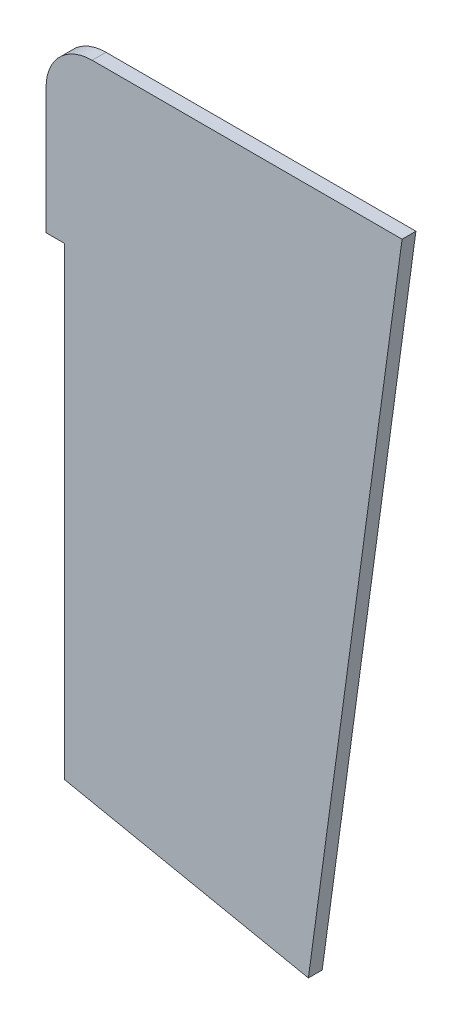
from build123d import *

# Parameters (mm, degrees)
RESSALTO_EXTRUS_O1_DEPTH = 3
FILETE1_R                = 10
CORTE_EXTRUS_O3_DEPTH    = 4


with BuildPart() as part:
    # Esbo_o2 → Ressalto-extrus_o1 (new body)
    with BuildSketch(Plane.XY):
        Polygon((236.744667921, 297.979893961), (179.797265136, 309.63253177), (179.797265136, 447.074042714), (257.090292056, 447.074042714), align=None)
    extrude(amount=-RESSALTO_EXTRUS_O1_DEPTH)

    # Filete1
    filete1_edges = [part.edges().sort_by_distance(p)[0] for p in [
        (179.797265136, 447.074042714, -1.5),
    ]]
    fillet(filete1_edges, radius=FILETE1_R)

    # Esbo_o5 → Corte-extrus_o3 (cut)
    with BuildSketch(Plane.ZY.offset(-179.797265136)):
        Polygon((-3, 409.63253177), (0, 409.63253177), (0.369317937, 304.984887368), (-3.544647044, 304.984887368), align=None)
    extrude(amount=-CORTE_EXTRUS_O3_DEPTH, mode=Mode.SUBTRACT)


solid = part.part
